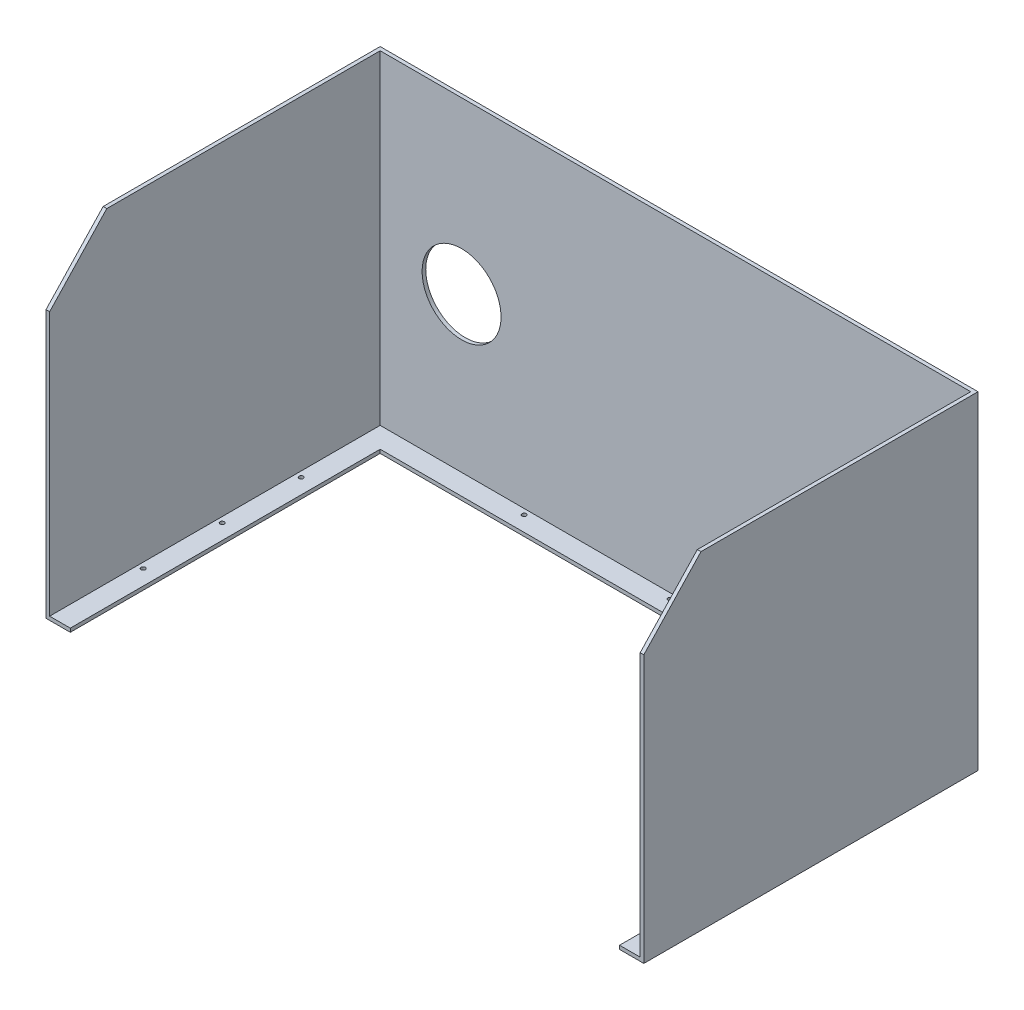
from build123d import *

# Parameters (mm, degrees)
SKETCH_1_W          = 492
SKETCH_1_H          = 270
EXTRUDE_2_DEPTH     = 3
EXTRUDE_3_DEPTH     = 3
EXTRUDE_4_DEPTH     = 3
EXTRUDE_5_DEPTH     = 3
SKETCH_5_R          = 20
SKETCH_5_R_2        = 32.5
CUT_EXTRUDE_1_DEPTH = 3
SKETCH_6_R          = 1.75
CUT_EXTRUDE_2_DEPTH = 3


with BuildPart() as part:
    # Sketch 1 → Extrude 2 (new body)
    with BuildSketch(Plane.XY):
        Rectangle(SKETCH_1_W, SKETCH_1_H)
    extrude(amount=EXTRUDE_2_DEPTH)

    # Sketch 2 → Extrude 3 (add)
    with BuildSketch(Plane.ZY.offset(246)):
        Polygon((3, 135), (3, -135), (275, -135), (275, 85), (228, 135), align=None)
    extrude(amount=-EXTRUDE_3_DEPTH)

    # Sketch 3 → Extrude 4 (add)
    with BuildSketch(Plane(origin=(246, 0, 0), x_dir=(0, 0, -1), z_dir=(1, 0, 0))):
        Polygon((-3, -135), (-3, 135), (-228, 135), (-275, 85), (-275, -135), align=None)
    extrude(amount=-EXTRUDE_4_DEPTH)

    # Sketch 4 → Extrude 5 (add)
    with BuildSketch(Plane.XZ.offset(135)):
        Polygon((-243, 3), (-243, 275), (-226, 275), (-226, 20), (226, 20), (226, 275), (243, 275), (243, 3), align=None)
    extrude(amount=-EXTRUDE_5_DEPTH)

    # Sketch 5 → Cut-Extrude 1 (cut)
    with BuildSketch(Plane(origin=(0, 0, 0), x_dir=(-1, 0, 0), z_dir=(0, 0, -1))):
        with Locations((-176, -5)):
            Circle(SKETCH_5_R)
        with Locations((176, -5)):
            Circle(SKETCH_5_R_2)
    extrude(amount=-CUT_EXTRUDE_1_DEPTH, mode=Mode.SUBTRACT)

    # Sketch 6 → Cut-Extrude 2 (cut)
    with BuildSketch(Plane.XZ.offset(135)):
        with Locations((-238.5, 202.5)):
            Circle(SKETCH_6_R)
        with Locations((-238.5, 137.5)):
            Circle(SKETCH_6_R)
        with Locations((-238.5, 72.5)):
            Circle(SKETCH_6_R)
        with Locations((-120, 7.5)):
            Circle(SKETCH_6_R)
        with Locations((0, 7.5)):
            Circle(SKETCH_6_R)
        with Locations((120, 7.5)):
            Circle(SKETCH_6_R)
        with Locations((238.5, 202.5)):
            Circle(SKETCH_6_R)
        with Locations((238.5, 137.5)):
            Circle(SKETCH_6_R)
        with Locations((238.5, 72.5)):
            Circle(SKETCH_6_R)
    extrude(amount=-CUT_EXTRUDE_2_DEPTH, mode=Mode.SUBTRACT)


solid = part.part
